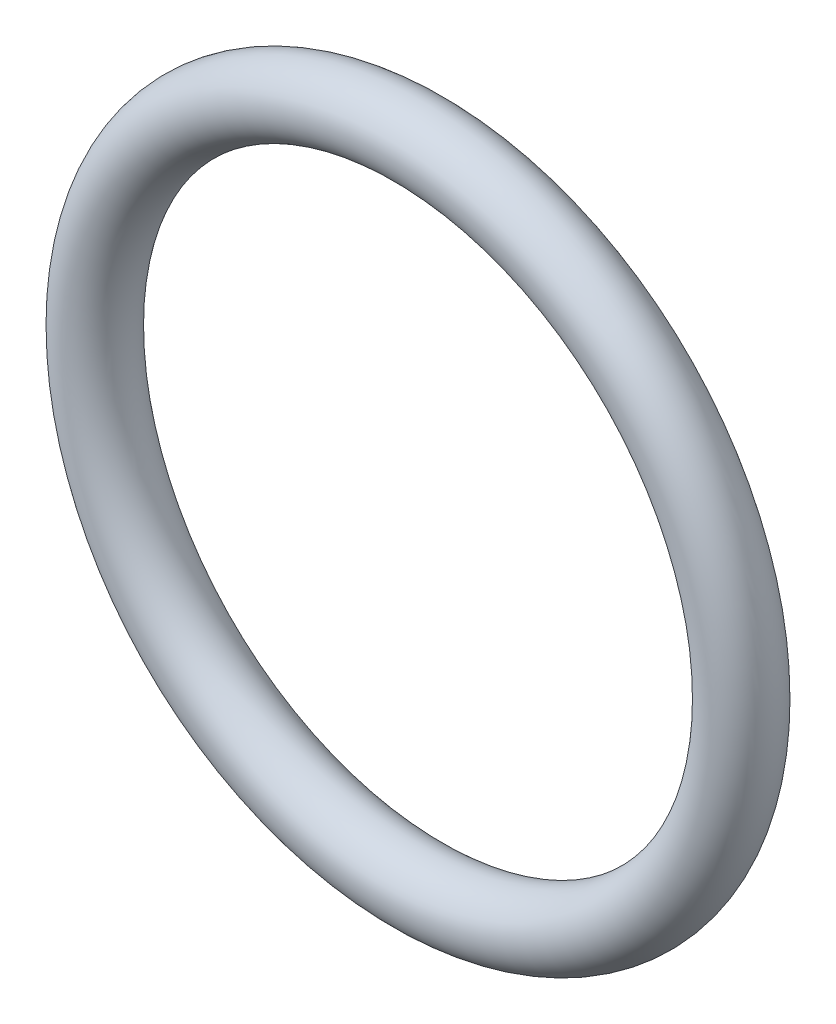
ISO-10303-21;
HEADER;
FILE_DESCRIPTION(('STEP AP214'),'2;1');
FILE_NAME('part.step','',(''),(''),'','','');
FILE_SCHEMA(('AUTOMOTIVE_DESIGN { 1 0 10303 214 1 1 1 1 }'));
ENDSEC;
DATA;
#1=APPLICATION_CONTEXT('core data for automotive mechanical design processes');
#2=APPLICATION_PROTOCOL_DEFINITION('international standard','automotive_design',2000,#1);
#3=PRODUCT_CONTEXT('',#1,'mechanical');
#4=PRODUCT('Part','Part','',(#3));
#5=PRODUCT_RELATED_PRODUCT_CATEGORY('part','',(#4));
#6=PRODUCT_DEFINITION_FORMATION('','',#4);
#7=PRODUCT_DEFINITION_CONTEXT('part definition',#1,'design');
#8=PRODUCT_DEFINITION('design','',#6,#7);
#9=PRODUCT_DEFINITION_SHAPE('','',#8);
#10=(LENGTH_UNIT() NAMED_UNIT(*) SI_UNIT(.MILLI.,.METRE.));
#11=(NAMED_UNIT(*) PLANE_ANGLE_UNIT() SI_UNIT($,.RADIAN.));
#12=(NAMED_UNIT(*) SI_UNIT($,.STERADIAN.) SOLID_ANGLE_UNIT());
#13=UNCERTAINTY_MEASURE_WITH_UNIT(LENGTH_MEASURE(1.E-05),#10,'distance_accuracy_value','');
#14=(GEOMETRIC_REPRESENTATION_CONTEXT(3) GLOBAL_UNCERTAINTY_ASSIGNED_CONTEXT((#13)) GLOBAL_UNIT_ASSIGNED_CONTEXT((#10,
#11,#12)) REPRESENTATION_CONTEXT('',''));
#15=CARTESIAN_POINT('',(0.,0.,0.));
#16=DIRECTION('',(0.,0.,1.));
#17=DIRECTION('',(1.,0.,0.));
#18=AXIS2_PLACEMENT_3D('',#15,#16,#17);
#19=CARTESIAN_POINT('',(0.,0.,0.));
#20=DIRECTION('',(0.,0.,-1.));
#21=DIRECTION('',(-1.,0.,0.));
#22=AXIS2_PLACEMENT_3D('',#19,#20,#21);
#23=TOROIDAL_SURFACE('',#22,12.2555,1.3081);
#24=ADVANCED_FACE('F13',(),#23,.T.);
#25=CLOSED_SHELL('',(#24));
#26=MANIFOLD_SOLID_BREP('B1',#25);
#27=ADVANCED_BREP_SHAPE_REPRESENTATION('',(#18,#26),#14);
#28=SHAPE_DEFINITION_REPRESENTATION(#9,#27);
ENDSEC;
END-ISO-10303-21;
